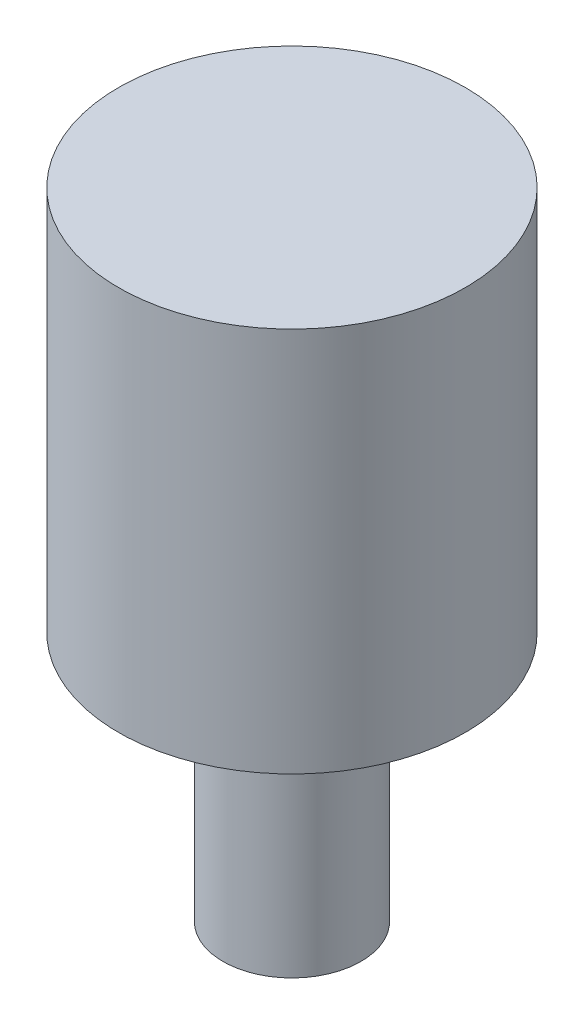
ISO-10303-21;
HEADER;
FILE_DESCRIPTION(('STEP AP214'),'2;1');
FILE_NAME('part.step','',(''),(''),'','','');
FILE_SCHEMA(('AUTOMOTIVE_DESIGN { 1 0 10303 214 1 1 1 1 }'));
ENDSEC;
DATA;
#1=APPLICATION_CONTEXT('core data for automotive mechanical design processes');
#2=APPLICATION_PROTOCOL_DEFINITION('international standard','automotive_design',2000,#1);
#3=PRODUCT_CONTEXT('',#1,'mechanical');
#4=PRODUCT('Part','Part','',(#3));
#5=PRODUCT_RELATED_PRODUCT_CATEGORY('part','',(#4));
#6=PRODUCT_DEFINITION_FORMATION('','',#4);
#7=PRODUCT_DEFINITION_CONTEXT('part definition',#1,'design');
#8=PRODUCT_DEFINITION('design','',#6,#7);
#9=PRODUCT_DEFINITION_SHAPE('','',#8);
#10=(LENGTH_UNIT() NAMED_UNIT(*) SI_UNIT(.MILLI.,.METRE.));
#11=(NAMED_UNIT(*) PLANE_ANGLE_UNIT() SI_UNIT($,.RADIAN.));
#12=(NAMED_UNIT(*) SI_UNIT($,.STERADIAN.) SOLID_ANGLE_UNIT());
#13=UNCERTAINTY_MEASURE_WITH_UNIT(LENGTH_MEASURE(1.E-05),#10,'distance_accuracy_value','');
#14=(GEOMETRIC_REPRESENTATION_CONTEXT(3) GLOBAL_UNCERTAINTY_ASSIGNED_CONTEXT((#13)) GLOBAL_UNIT_ASSIGNED_CONTEXT((#10,
#11,#12)) REPRESENTATION_CONTEXT('',''));
#15=CARTESIAN_POINT('',(0.,0.,0.));
#16=DIRECTION('',(0.,0.,1.));
#17=DIRECTION('',(1.,0.,0.));
#18=AXIS2_PLACEMENT_3D('',#15,#16,#17);
#19=CARTESIAN_POINT('',(0.,13.096875,0.));
#20=DIRECTION('',(0.,1.,0.));
#21=DIRECTION('',(0.,0.,1.));
#22=AXIS2_PLACEMENT_3D('',#19,#20,#21);
#23=PLANE('',#22);
#24=CARTESIAN_POINT('',(0.,13.096875,0.));
#25=DIRECTION('',(0.,-1.,0.));
#26=DIRECTION('',(0.,0.,-1.));
#27=AXIS2_PLACEMENT_3D('',#24,#25,#26);
#28=CIRCLE('',#27,3.571875);
#29=CARTESIAN_POINT('',(0.,13.096875,-3.571875));
#30=VERTEX_POINT('',#29);
#31=EDGE_CURVE('E10',#30,#30,#28,.T.);
#32=ORIENTED_EDGE('',*,*,#31,.F.);
#33=EDGE_LOOP('',(#32));
#34=FACE_BOUND('',#33,.T.);
#35=ADVANCED_FACE('F30',(#34),#23,.T.);
#36=CARTESIAN_POINT('',(0.,0.,0.));
#37=DIRECTION('',(0.,-1.,0.));
#38=DIRECTION('',(0.,0.,-1.));
#39=AXIS2_PLACEMENT_3D('',#36,#37,#38);
#40=CYLINDRICAL_SURFACE('',#39,3.571875);
#41=ORIENTED_EDGE('',*,*,#31,.T.);
#42=EDGE_LOOP('',(#41));
#43=FACE_BOUND('',#42,.T.);
#44=CARTESIAN_POINT('',(0.,5.159375,0.));
#45=DIRECTION('',(0.,-1.,0.));
#46=DIRECTION('',(0.,0.,-1.));
#47=AXIS2_PLACEMENT_3D('',#44,#45,#46);
#48=CIRCLE('',#47,3.571875);
#49=CARTESIAN_POINT('',(0.,5.159375,-3.571875));
#50=VERTEX_POINT('',#49);
#51=EDGE_CURVE('E36',#50,#50,#48,.T.);
#52=ORIENTED_EDGE('',*,*,#51,.F.);
#53=EDGE_LOOP('',(#52));
#54=FACE_BOUND('',#53,.T.);
#55=ADVANCED_FACE('F62',(#43,#54),#40,.T.);
#56=CARTESIAN_POINT('',(3.571875,5.159375,0.));
#57=DIRECTION('',(0.,-1.,0.));
#58=DIRECTION('',(0.,0.,-1.));
#59=AXIS2_PLACEMENT_3D('',#56,#57,#58);
#60=PLANE('',#59);
#61=ORIENTED_EDGE('',*,*,#51,.T.);
#62=EDGE_LOOP('',(#61));
#63=FACE_BOUND('',#62,.T.);
#64=CARTESIAN_POINT('',(0.,5.159375,0.));
#65=DIRECTION('',(0.,-1.,0.));
#66=DIRECTION('',(0.,0.,-1.));
#67=AXIS2_PLACEMENT_3D('',#64,#65,#66);
#68=CIRCLE('',#67,1.4224);
#69=CARTESIAN_POINT('',(0.,5.159375,-1.4224));
#70=VERTEX_POINT('',#69);
#71=EDGE_CURVE('E40',#70,#70,#68,.T.);
#72=ORIENTED_EDGE('',*,*,#71,.F.);
#73=EDGE_LOOP('',(#72));
#74=FACE_BOUND('',#73,.T.);
#75=ADVANCED_FACE('F54',(#63,#74),#60,.T.);
#76=CARTESIAN_POINT('',(0.,0.,0.));
#77=DIRECTION('',(0.,-1.,0.));
#78=DIRECTION('',(0.,0.,-1.));
#79=AXIS2_PLACEMENT_3D('',#76,#77,#78);
#80=CYLINDRICAL_SURFACE('',#79,1.4224);
#81=ORIENTED_EDGE('',*,*,#71,.T.);
#82=EDGE_LOOP('',(#81));
#83=FACE_BOUND('',#82,.T.);
#84=CARTESIAN_POINT('',(0.,0.,0.));
#85=DIRECTION('',(0.,-1.,0.));
#86=DIRECTION('',(0.,0.,-1.));
#87=AXIS2_PLACEMENT_3D('',#84,#85,#86);
#88=CIRCLE('',#87,1.4224);
#89=CARTESIAN_POINT('',(0.,0.,-1.4224));
#90=VERTEX_POINT('',#89);
#91=EDGE_CURVE('E44',#90,#90,#88,.T.);
#92=ORIENTED_EDGE('',*,*,#91,.F.);
#93=EDGE_LOOP('',(#92));
#94=FACE_BOUND('',#93,.T.);
#95=ADVANCED_FACE('F52',(#83,#94),#80,.T.);
#96=CARTESIAN_POINT('',(1.4224,0.,0.));
#97=DIRECTION('',(0.,-1.,0.));
#98=DIRECTION('',(0.,0.,-1.));
#99=AXIS2_PLACEMENT_3D('',#96,#97,#98);
#100=PLANE('',#99);
#101=ORIENTED_EDGE('',*,*,#91,.T.);
#102=EDGE_LOOP('',(#101));
#103=FACE_BOUND('',#102,.T.);
#104=ADVANCED_FACE('F50',(#103),#100,.T.);
#105=CLOSED_SHELL('',(#35,#55,#75,#95,#104));
#106=MANIFOLD_SOLID_BREP('B2',#105);
#107=ADVANCED_BREP_SHAPE_REPRESENTATION('',(#18,#106),#14);
#108=SHAPE_DEFINITION_REPRESENTATION(#9,#107);
ENDSEC;
END-ISO-10303-21;
